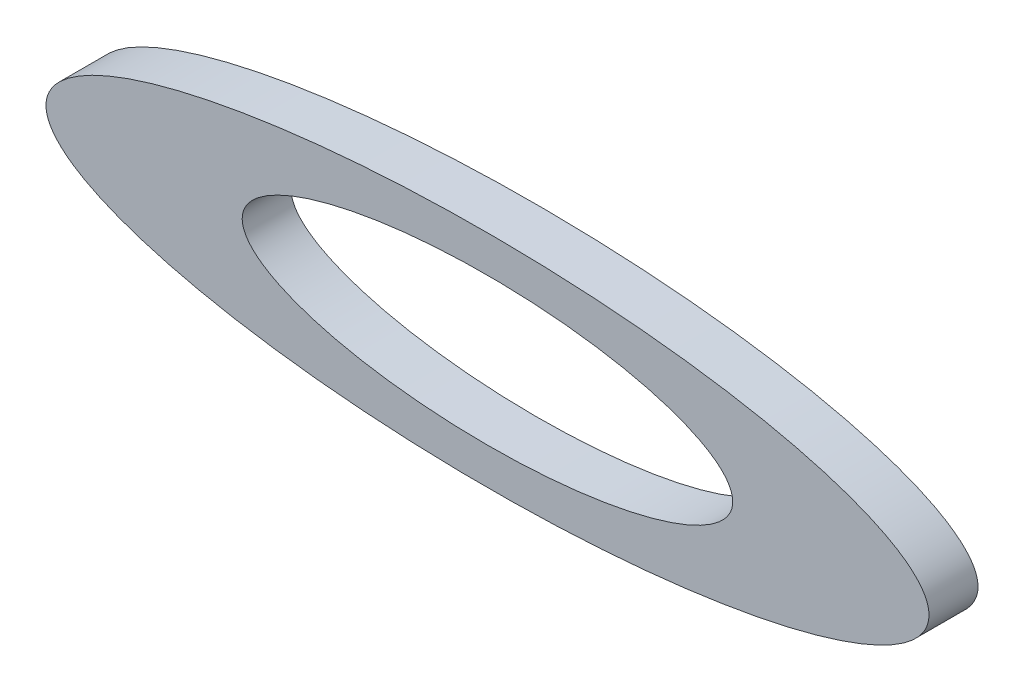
from build123d import *

# Parameters (mm, degrees)
SKETCH1_RX     = 90
SKETCH1_RY     = 22.5
SKETCH1_RX_2   = 50
SKETCH1_RY_2   = 15
EXTRUDE1_DEPTH = 10


with BuildPart() as part:
    # Sketch1 → Extrude1 (new body)
    with BuildSketch(Plane.XY):
        with Locations((0, 0)):
            Ellipse(SKETCH1_RX, SKETCH1_RY)
        with Locations((0, 0)):
            Ellipse(SKETCH1_RX_2, SKETCH1_RY_2, mode=Mode.SUBTRACT)
    extrude(amount=EXTRUDE1_DEPTH)


solid = part.part
